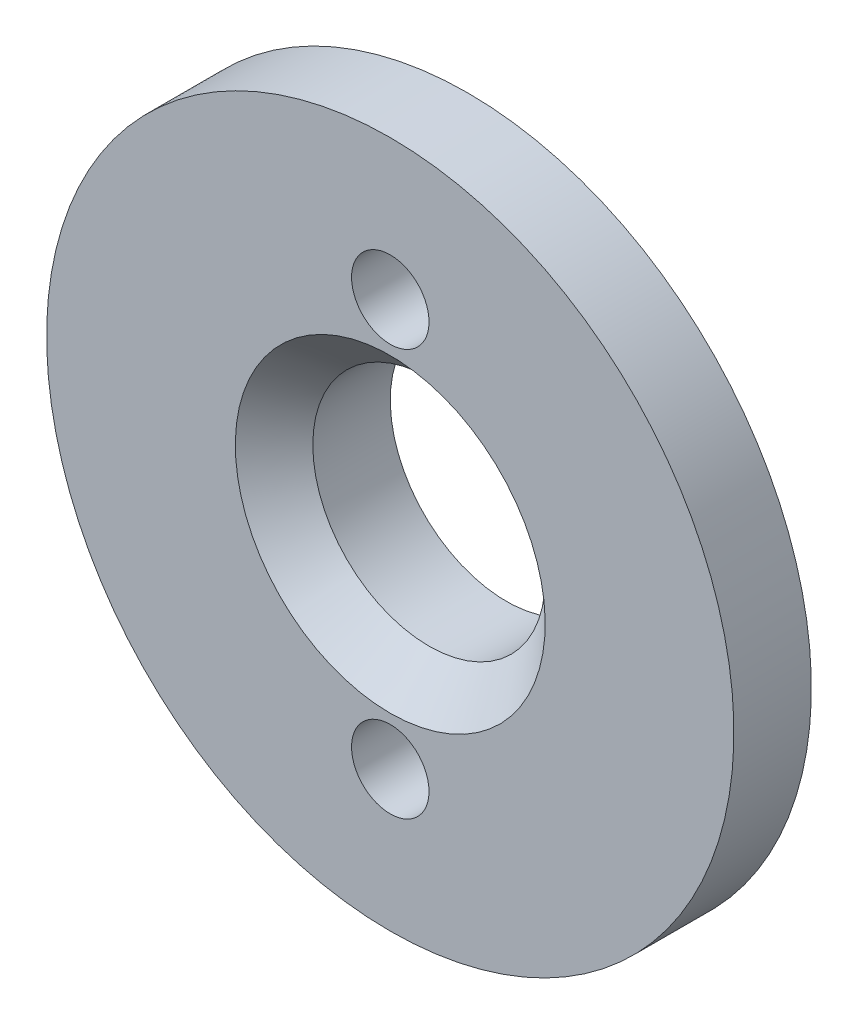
from build123d import *

# Parameters (mm, degrees)
F_3_8_0_375_DIAMETER_HOLE1_D     = 9.525
CHAMFER1_SIZE                    = 1.5875
F_1_8_0_125_DIAMETER_HOLE1_D     = 3.175
F_1_8_0_125_DIAMETER_HOLE1_DEPTH = 4.318
F_1_8_0_125_DIAMETER_HOLE1_TIP   = 1.826209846


with BuildPart() as part:
    # Sketch1 → Revolve1 (revolve)
    with BuildSketch(Plane(origin=(0, 0, 0), x_dir=(0, 0, -1), z_dir=(1, 0, 0))):
        Polygon((-2.38125, 0), (-2.38125, 14.0843), (0.79375, 14.0843), (0.79375, 6.3246), (2.38125, 6.3246), (2.38125, 0), align=None)
    revolve(axis=Axis((0, 0, -36.408094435), (0, 0, 1)))

    # 3_8 _0.375_ Diameter Hole1 (through all)
    with Locations(Plane(origin=(0, 0, -2.38125), x_dir=(-1, 0, 0), z_dir=(0, 0, -1))):
        with Locations((0, 0)):
            Hole(F_3_8_0_375_DIAMETER_HOLE1_D / 2)

    # Chamfer1
    chamfer1_edges = [part.edges().sort_by_distance(p)[0] for p in [
        (-4.7625, 0, 2.38125),
    ]]
    chamfer(chamfer1_edges, length=CHAMFER1_SIZE)

    # 1_8 _0.125_ Diameter Hole1
    with Locations(Plane(origin=(0, 0, -0.79375), x_dir=(-1, 0, 0), z_dir=(0, 0, -1))):
        with Locations((0, 8.334375), (0, -8.334375)):
            Hole(F_1_8_0_125_DIAMETER_HOLE1_D / 2, depth=F_1_8_0_125_DIAMETER_HOLE1_DEPTH)
            with Locations((0, 0, -(F_1_8_0_125_DIAMETER_HOLE1_DEPTH + F_1_8_0_125_DIAMETER_HOLE1_TIP / 2))):  # 82° drill point
                Cone(0, F_1_8_0_125_DIAMETER_HOLE1_D / 2, F_1_8_0_125_DIAMETER_HOLE1_TIP, mode=Mode.SUBTRACT)


solid = part.part
